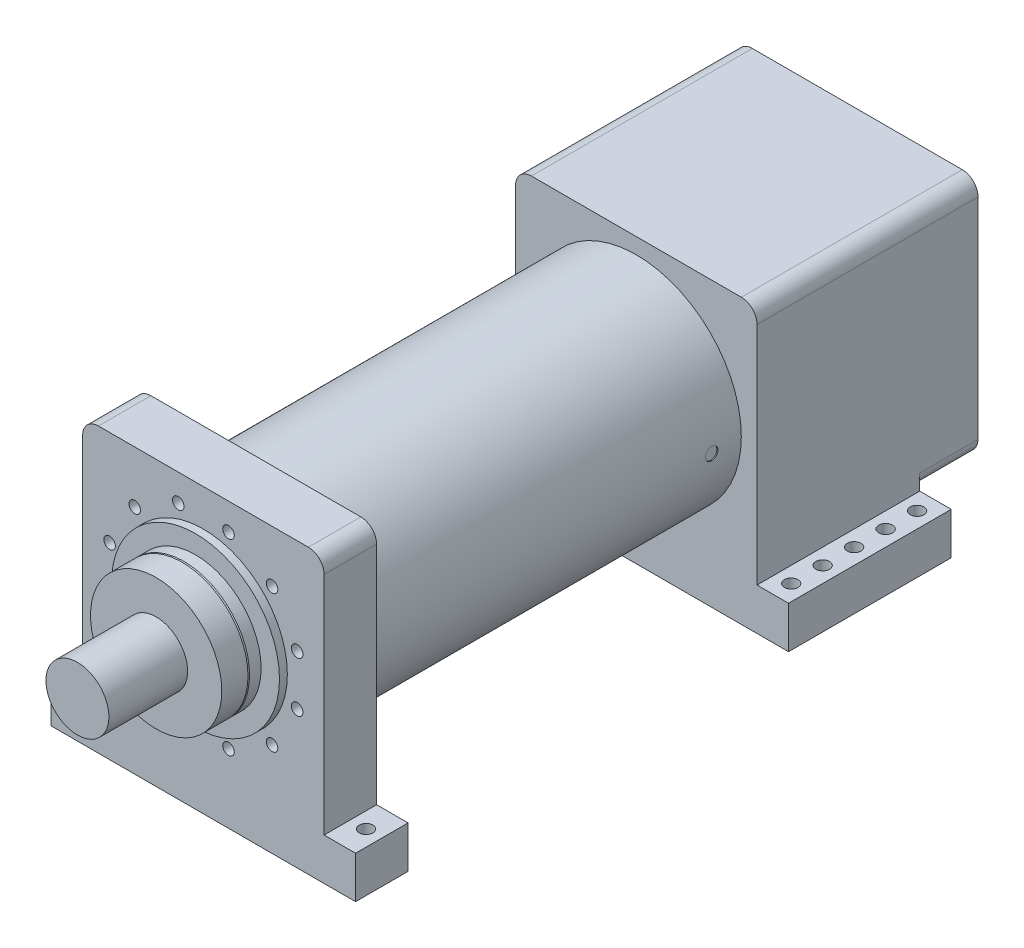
from build123d import *

# Parameters (mm, degrees)
SKETCH_1_R          = 200
EXTRUDE_1_DEPTH     = 725
SKETCH_2_W          = 460
SKETCH_2_H          = 460
SKETCH_2_R          = 11
EXTRUDE_2_DEPTH     = 100
SKETCH_6_W          = 460
SKETCH_6_H          = 460
EXTRUDE_6_DEPTH     = 50
SKETCH_9_R          = 12
CUT_EXTRUDE_2_DEPTH = 2
SKETCH_10_R         = 12
CUT_EXTRUDE_3_DEPTH = 2
SKETCH_16_W         = 460
SKETCH_16_H         = 460
EXTRUDE_12_DEPTH    = 260
SKETCH_17_W         = 460
SKETCH_17_H         = 460
EXTRUDE_13_DEPTH    = 111
SKETCH_21_R         = 160
EXTRUDE_18_DEPTH    = 15
SKETCH_22_R         = 125
EXTRUDE_19_DEPTH    = 25
CHAMFER_3_SIZE      = 3
CHAMFER_3_SIZE2     = 1.091910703
SKETCH_23_R         = 125
EXTRUDE_20_DEPTH    = 50
SKETCH_24_R         = 60
EXTRUDE_21_DEPTH    = 150
SKETCH_25_W         = 580
SKETCH_25_H         = 310
SKETCH_25_R         = 13
SKETCH_25_H_2       = 100
EXTRUDE_22_DEPTH    = 80
FILLET_4_R          = 30


with BuildPart() as part:
    # Sketch 1 → Extrude 1 (new body)
    with BuildSketch(Plane.XY):
        Circle(SKETCH_1_R)
    extrude(amount=EXTRUDE_1_DEPTH)

    # Sketch 2 → Extrude 2 (add)
    with BuildSketch(Plane.XY.offset(725)):
        Rectangle(SKETCH_2_W, SKETCH_2_H)
        with Locations((178.696277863, 47.881523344)):
            Circle(SKETCH_2_R, mode=Mode.SUBTRACT)
        with Locations((178.696277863, -47.881523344)):
            Circle(SKETCH_2_R, mode=Mode.SUBTRACT)
        with Locations((130.81475452, -130.81475452)):
            Circle(SKETCH_2_R, mode=Mode.SUBTRACT)
        with Locations((47.881523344, -178.696277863)):
            Circle(SKETCH_2_R, mode=Mode.SUBTRACT)
        with Locations((-47.881523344, -178.696277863)):
            Circle(SKETCH_2_R, mode=Mode.SUBTRACT)
        with Locations((-130.81475452, -130.81475452)):
            Circle(SKETCH_2_R, mode=Mode.SUBTRACT)
        with Locations((-178.696277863, -47.881523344)):
            Circle(SKETCH_2_R, mode=Mode.SUBTRACT)
        with Locations((-178.696277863, 47.881523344)):
            Circle(SKETCH_2_R, mode=Mode.SUBTRACT)
        with Locations((-130.81475452, 130.814754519)):
            Circle(SKETCH_2_R, mode=Mode.SUBTRACT)
        with Locations((-47.881523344, 178.696277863)):
            Circle(SKETCH_2_R, mode=Mode.SUBTRACT)
        with Locations((47.881523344, 178.696277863)):
            Circle(SKETCH_2_R, mode=Mode.SUBTRACT)
        with Locations((130.81475452, 130.81475452)):
            Circle(SKETCH_2_R, mode=Mode.SUBTRACT)
    extrude(amount=EXTRUDE_2_DEPTH)

    # Sketch 6 → Extrude 6 (add)
    with BuildSketch(Plane(origin=(0, 0, 0), x_dir=(-1, 0, 0), z_dir=(0, 0, -1))):
        Rectangle(SKETCH_6_W, SKETCH_6_H)
    extrude(amount=EXTRUDE_6_DEPTH)

    # Sketch 9 → Cut-Extrude 2 (cut)
    with BuildSketch(Plane(origin=(-200, 0, 0), x_dir=(0, 0, -1), z_dir=(1, 0, 0))):
        with Locations(Location((-36.5, 0, 0), (0, 0, 180))):
            Circle(SKETCH_9_R)
        with Locations(Location((-670.5, 0, 0), (0, 0, 180))):
            Circle(SKETCH_9_R)
    extrude(amount=CUT_EXTRUDE_2_DEPTH, mode=Mode.SUBTRACT)

    # Sketch 10 → Cut-Extrude 3 (cut)
    with BuildSketch(Plane(origin=(200, 0, 0), x_dir=(0, 0, -1), z_dir=(1, 0, 0))):
        with Locations((-56.5, 0)):
            Circle(SKETCH_10_R)
    extrude(amount=-CUT_EXTRUDE_3_DEPTH, mode=Mode.SUBTRACT)

    # Sketch 21 → Extrude 18 (add)
    with BuildSketch(Plane.XY.offset(825)):
        Circle(SKETCH_21_R)
    extrude(amount=EXTRUDE_18_DEPTH)

    # Sketch 22 → Extrude 19 (add)
    with BuildSketch(Plane.XY.offset(840)):
        Circle(SKETCH_22_R)
    extrude(amount=EXTRUDE_19_DEPTH)

    # Chamfer 3
    chamfer_3_edges = [part.edges().sort_by_distance(p)[0] for p in [
        (-125, 0, 865),
    ]]
    chamfer_3_side = [part.faces().sort_by_distance(p)[0] for p in [
        (-125, 0, 852.5),
    ]]
    chamfer(chamfer_3_edges, length=CHAMFER_3_SIZE, length2=CHAMFER_3_SIZE2, reference=chamfer_3_side[0])



with BuildPart() as body_2:
    # Sketch 16 → Extrude 12 (new body)
    with BuildSketch(Plane(origin=(0, 0, -50), x_dir=(-1, 0, 0), z_dir=(0, 0, -1))):
        Rectangle(SKETCH_16_W, SKETCH_16_H)
    extrude(amount=EXTRUDE_12_DEPTH)


with BuildPart() as body_3:
    # Sketch 17 → Extrude 13 (new body)
    with BuildSketch(Plane(origin=(0, 0, -310), x_dir=(-1, 0, 0), z_dir=(0, 0, -1))):
        Rectangle(SKETCH_17_W, SKETCH_17_H)
    extrude(amount=EXTRUDE_13_DEPTH)


with BuildPart() as body_4:
    # Sketch 23 → Extrude 20 (new body)
    with BuildSketch(Plane.XY.offset(865)):
        Circle(SKETCH_23_R)
    extrude(amount=EXTRUDE_20_DEPTH)


with BuildPart() as body_5:
    # Sketch 24 → Extrude 21 (new body)
    with BuildSketch(Plane.XY.offset(915)):
        Circle(SKETCH_24_R)
    extrude(amount=EXTRUDE_21_DEPTH)


with BuildPart() as part_1:
    add(part.part)

    add(body_2.part)  # Extrude 22 merges body 2

    add(body_3.part)  # Extrude 22 merges body 3
    # Sketch 25 → Extrude 22 (add)
    # profile 1 of 2: a face of its own
    with BuildSketch(Plane.XZ.offset(230)):
        with Locations((0, -155)):
            Rectangle(SKETCH_25_W, SKETCH_25_H)
        with Locations(Location((-260, -275, 0), (0, 0, 270))):
            Circle(SKETCH_25_R, mode=Mode.SUBTRACT)
        with Locations(Location((-260, -215, 0), (0, 0, 270))):
            Circle(SKETCH_25_R, mode=Mode.SUBTRACT)
        with Locations(Location((-260, -155, 0), (0, 0, 270))):
            Circle(SKETCH_25_R, mode=Mode.SUBTRACT)
        with Locations(Location((-260, -95, 0), (0, 0, 270))):
            Circle(SKETCH_25_R, mode=Mode.SUBTRACT)
        with Locations(Location((-260, -35, 0), (0, 0, 270))):
            Circle(SKETCH_25_R, mode=Mode.SUBTRACT)
        with Locations(Location((260, -35, 0), (0, 0, 90))):
            Circle(SKETCH_25_R, mode=Mode.SUBTRACT)
        with Locations(Location((260, -95, 0), (0, 0, 90))):
            Circle(SKETCH_25_R, mode=Mode.SUBTRACT)
        with Locations(Location((260, -155, 0), (0, 0, 90))):
            Circle(SKETCH_25_R, mode=Mode.SUBTRACT)
        with Locations(Location((260, -215, 0), (0, 0, 90))):
            Circle(SKETCH_25_R, mode=Mode.SUBTRACT)
        with Locations(Location((260, -275, 0), (0, 0, 90))):
            Circle(SKETCH_25_R, mode=Mode.SUBTRACT)
    # profile 2 of 2: a face of its own
    with BuildSketch(Plane.XZ.offset(230)):
        with Locations((0, 775)):
            Rectangle(SKETCH_25_W, SKETCH_25_H_2)
        with Locations(Location((-260, 775, 0), (0, 0, 270))):
            Circle(SKETCH_25_R, mode=Mode.SUBTRACT)
        with Locations(Location((260, 775, 0), (0, 0, 90))):
            Circle(SKETCH_25_R, mode=Mode.SUBTRACT)
    extrude(amount=EXTRUDE_22_DEPTH)

    # Fillet 4
    fillet_4_edges = [part_1.edges().sort_by_distance(p)[0] for p in [
        (-230, -230, -365.5),
        (230, -230, -365.5),
        (230, 230, 775),
        (-230, 230, 775),
        (230, 230, -210.5),
        (-230, 230, -210.5),
    ]]
    fillet(fillet_4_edges, radius=FILLET_4_R)


solid = Compound([body_4.part, body_5.part, part_1.part])
